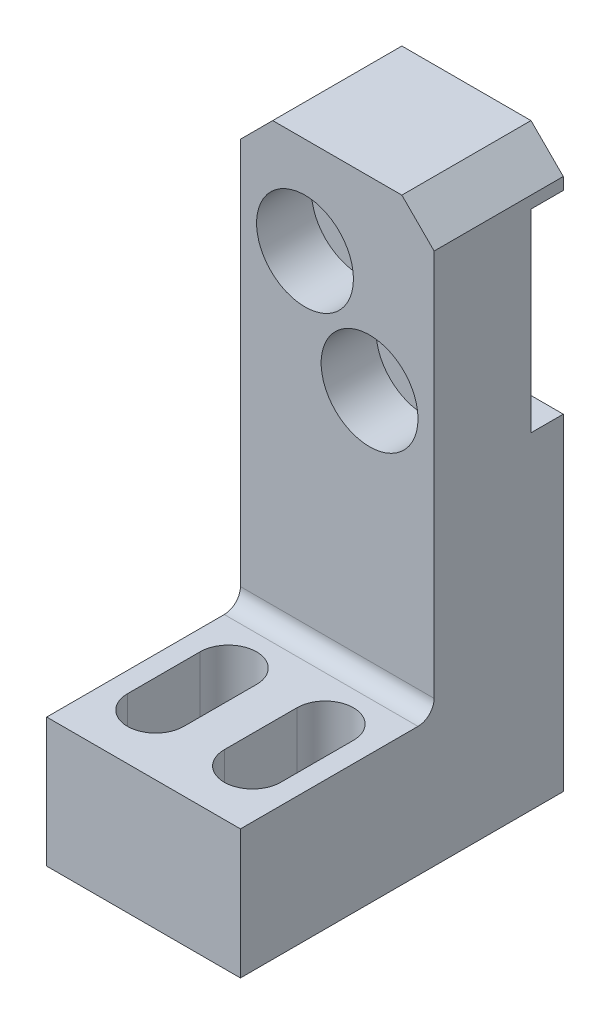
ISO-10303-21;
HEADER;
FILE_DESCRIPTION(('STEP AP214'),'2;1');
FILE_NAME('part.step','',(''),(''),'','','');
FILE_SCHEMA(('AUTOMOTIVE_DESIGN { 1 0 10303 214 1 1 1 1 }'));
ENDSEC;
DATA;
#1=APPLICATION_CONTEXT('core data for automotive mechanical design processes');
#2=APPLICATION_PROTOCOL_DEFINITION('international standard','automotive_design',2000,#1);
#3=PRODUCT_CONTEXT('',#1,'mechanical');
#4=PRODUCT('Part','Part','',(#3));
#5=PRODUCT_RELATED_PRODUCT_CATEGORY('part','',(#4));
#6=PRODUCT_DEFINITION_FORMATION('','',#4);
#7=PRODUCT_DEFINITION_CONTEXT('part definition',#1,'design');
#8=PRODUCT_DEFINITION('design','',#6,#7);
#9=PRODUCT_DEFINITION_SHAPE('','',#8);
#10=(LENGTH_UNIT() NAMED_UNIT(*) SI_UNIT(.MILLI.,.METRE.));
#11=(NAMED_UNIT(*) PLANE_ANGLE_UNIT() SI_UNIT($,.RADIAN.));
#12=(NAMED_UNIT(*) SI_UNIT($,.STERADIAN.) SOLID_ANGLE_UNIT());
#13=UNCERTAINTY_MEASURE_WITH_UNIT(LENGTH_MEASURE(1.E-05),#10,'distance_accuracy_value','');
#14=(GEOMETRIC_REPRESENTATION_CONTEXT(3) GLOBAL_UNCERTAINTY_ASSIGNED_CONTEXT((#13)) GLOBAL_UNIT_ASSIGNED_CONTEXT((#10,
#11,#12)) REPRESENTATION_CONTEXT('',''));
#15=CARTESIAN_POINT('',(0.,0.,0.));
#16=DIRECTION('',(0.,0.,1.));
#17=DIRECTION('',(1.,0.,0.));
#18=AXIS2_PLACEMENT_3D('',#15,#16,#17);
#19=CARTESIAN_POINT('',(0.,-35.,8.));
#20=DIRECTION('',(0.,1.,0.));
#21=DIRECTION('',(0.,0.,1.));
#22=AXIS2_PLACEMENT_3D('',#19,#20,#21);
#23=PLANE('',#22);
#24=DIRECTION('',(0.,0.,-1.));
#25=VECTOR('',#24,1.);
#26=CARTESIAN_POINT('',(1.25000000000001,-35.,16.25));
#27=LINE('',#26,#25);
#28=CARTESIAN_POINT('',(1.25,-35.,16.25));
#29=VERTEX_POINT('',#28);
#30=CARTESIAN_POINT('',(1.25000000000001,-35.,11.75));
#31=VERTEX_POINT('',#30);
#32=EDGE_CURVE('E199',#29,#31,#27,.T.);
#33=ORIENTED_EDGE('',*,*,#32,.F.);
#34=CARTESIAN_POINT('',(3.,-35.,16.25));
#35=DIRECTION('',(0.,1.,0.));
#36=DIRECTION('',(0.,0.,1.));
#37=AXIS2_PLACEMENT_3D('',#34,#35,#36);
#38=CIRCLE('',#37,1.75);
#39=CARTESIAN_POINT('',(4.75,-35.,16.25));
#40=VERTEX_POINT('',#39);
#41=EDGE_CURVE('E210',#29,#40,#38,.T.);
#42=ORIENTED_EDGE('',*,*,#41,.T.);
#43=DIRECTION('',(0.,0.,-1.));
#44=VECTOR('',#43,1.);
#45=CARTESIAN_POINT('',(4.75,-35.,16.25));
#46=LINE('',#45,#44);
#47=CARTESIAN_POINT('',(4.75,-35.,11.75));
#48=VERTEX_POINT('',#47);
#49=EDGE_CURVE('E196',#40,#48,#46,.T.);
#50=ORIENTED_EDGE('',*,*,#49,.T.);
#51=CARTESIAN_POINT('',(3.,-35.,11.75));
#52=DIRECTION('',(0.,1.,0.));
#53=DIRECTION('',(0.,0.,1.));
#54=AXIS2_PLACEMENT_3D('',#51,#52,#53);
#55=CIRCLE('',#54,1.75);
#56=EDGE_CURVE('E220',#48,#31,#55,.T.);
#57=ORIENTED_EDGE('',*,*,#56,.T.);
#58=EDGE_LOOP('',(#33,#42,#50,#57));
#59=FACE_BOUND('',#58,.T.);
#60=DIRECTION('',(1.,0.,0.));
#61=VECTOR('',#60,1.);
#62=CARTESIAN_POINT('',(0.,-35.,0.));
#63=LINE('',#62,#61);
#64=CARTESIAN_POINT('',(0.,-35.,0.));
#65=VERTEX_POINT('',#64);
#66=CARTESIAN_POINT('',(12.,-35.,0.));
#67=VERTEX_POINT('',#66);
#68=EDGE_CURVE('E313',#65,#67,#63,.T.);
#69=ORIENTED_EDGE('',*,*,#68,.T.);
#70=DIRECTION('',(0.,0.,-1.));
#71=VECTOR('',#70,1.);
#72=CARTESIAN_POINT('',(12.,-35.,8.));
#73=LINE('',#72,#71);
#74=CARTESIAN_POINT('',(12.,-35.,20.));
#75=VERTEX_POINT('',#74);
#76=EDGE_CURVE('E304',#75,#67,#73,.T.);
#77=ORIENTED_EDGE('',*,*,#76,.F.);
#78=DIRECTION('',(-1.,0.,0.));
#79=VECTOR('',#78,1.);
#80=CARTESIAN_POINT('',(12.,-35.,20.));
#81=LINE('',#80,#79);
#82=CARTESIAN_POINT('',(0.,-35.,20.));
#83=VERTEX_POINT('',#82);
#84=EDGE_CURVE('E275',#75,#83,#81,.T.);
#85=ORIENTED_EDGE('',*,*,#84,.T.);
#86=DIRECTION('',(0.,0.,-1.));
#87=VECTOR('',#86,1.);
#88=CARTESIAN_POINT('',(0.,-35.,8.));
#89=LINE('',#88,#87);
#90=EDGE_CURVE('E308',#83,#65,#89,.T.);
#91=ORIENTED_EDGE('',*,*,#90,.T.);
#92=EDGE_LOOP('',(#69,#77,#85,#91));
#93=FACE_BOUND('',#92,.T.);
#94=DIRECTION('',(0.,0.,-1.));
#95=VECTOR('',#94,1.);
#96=CARTESIAN_POINT('',(7.25,-35.,16.25));
#97=LINE('',#96,#95);
#98=CARTESIAN_POINT('',(7.25,-35.,16.25));
#99=VERTEX_POINT('',#98);
#100=CARTESIAN_POINT('',(7.25,-35.,11.75));
#101=VERTEX_POINT('',#100);
#102=EDGE_CURVE('E169',#99,#101,#97,.T.);
#103=ORIENTED_EDGE('',*,*,#102,.F.);
#104=CARTESIAN_POINT('',(9.,-35.,16.25));
#105=DIRECTION('',(0.,1.,0.));
#106=DIRECTION('',(0.,0.,1.));
#107=AXIS2_PLACEMENT_3D('',#104,#105,#106);
#108=CIRCLE('',#107,1.75);
#109=CARTESIAN_POINT('',(10.75,-35.,16.25));
#110=VERTEX_POINT('',#109);
#111=EDGE_CURVE('E175',#99,#110,#108,.T.);
#112=ORIENTED_EDGE('',*,*,#111,.T.);
#113=DIRECTION('',(0.,0.,-1.));
#114=VECTOR('',#113,1.);
#115=CARTESIAN_POINT('',(10.75,-35.,16.25));
#116=LINE('',#115,#114);
#117=CARTESIAN_POINT('',(10.75,-35.,11.75));
#118=VERTEX_POINT('',#117);
#119=EDGE_CURVE('E158',#110,#118,#116,.T.);
#120=ORIENTED_EDGE('',*,*,#119,.T.);
#121=CARTESIAN_POINT('',(9.,-35.,11.75));
#122=DIRECTION('',(0.,1.,0.));
#123=DIRECTION('',(0.,0.,1.));
#124=AXIS2_PLACEMENT_3D('',#121,#122,#123);
#125=CIRCLE('',#124,1.75);
#126=EDGE_CURVE('E190',#118,#101,#125,.T.);
#127=ORIENTED_EDGE('',*,*,#126,.T.);
#128=EDGE_LOOP('',(#103,#112,#120,#127));
#129=FACE_BOUND('',#128,.T.);
#130=ADVANCED_FACE('F16',(#59,#93,#129),#23,.F.);
#131=CARTESIAN_POINT('',(0.,0.,0.));
#132=DIRECTION('',(0.,0.,1.));
#133=DIRECTION('',(1.,0.,0.));
#134=AXIS2_PLACEMENT_3D('',#131,#132,#133);
#135=PLANE('',#134);
#136=DIRECTION('',(-1.,0.,0.));
#137=VECTOR('',#136,1.);
#138=CARTESIAN_POINT('',(0.,0.,0.));
#139=LINE('',#138,#137);
#140=CARTESIAN_POINT('',(10.,0.,0.));
#141=VERTEX_POINT('',#140);
#142=CARTESIAN_POINT('',(2.,0.,0.));
#143=VERTEX_POINT('',#142);
#144=EDGE_CURVE('E287',#141,#143,#139,.T.);
#145=ORIENTED_EDGE('',*,*,#144,.F.);
#146=DIRECTION('',(-0.707106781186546,0.707106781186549,0.));
#147=VECTOR('',#146,1.);
#148=CARTESIAN_POINT('',(10.,0.,0.));
#149=LINE('',#148,#147);
#150=CARTESIAN_POINT('',(12.,-2.,0.));
#151=VERTEX_POINT('',#150);
#152=EDGE_CURVE('E349',#141,#151,#149,.F.);
#153=ORIENTED_EDGE('',*,*,#152,.T.);
#154=DIRECTION('',(0.,1.,0.));
#155=VECTOR('',#154,1.);
#156=CARTESIAN_POINT('',(12.,0.,0.));
#157=LINE('',#156,#155);
#158=CARTESIAN_POINT('',(12.,-2.75,0.));
#159=VERTEX_POINT('',#158);
#160=EDGE_CURVE('E315',#159,#151,#157,.T.);
#161=ORIENTED_EDGE('',*,*,#160,.F.);
#162=DIRECTION('',(-1.,0.,0.));
#163=VECTOR('',#162,1.);
#164=CARTESIAN_POINT('',(0.,-2.75,0.));
#165=LINE('',#164,#163);
#166=CARTESIAN_POINT('',(0.,-2.75,0.));
#167=VERTEX_POINT('',#166);
#168=EDGE_CURVE('E333',#159,#167,#165,.T.);
#169=ORIENTED_EDGE('',*,*,#168,.T.);
#170=DIRECTION('',(0.,-1.,0.));
#171=VECTOR('',#170,1.);
#172=CARTESIAN_POINT('',(0.,0.,0.));
#173=LINE('',#172,#171);
#174=CARTESIAN_POINT('',(0.,-2.,0.));
#175=VERTEX_POINT('',#174);
#176=EDGE_CURVE('E311',#175,#167,#173,.T.);
#177=ORIENTED_EDGE('',*,*,#176,.F.);
#178=DIRECTION('',(-0.707106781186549,-0.707106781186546,0.));
#179=VECTOR('',#178,1.);
#180=CARTESIAN_POINT('',(0.,-2.,0.));
#181=LINE('',#180,#179);
#182=EDGE_CURVE('E348',#175,#143,#181,.F.);
#183=ORIENTED_EDGE('',*,*,#182,.T.);
#184=EDGE_LOOP('',(#145,#153,#161,#169,#177,#183));
#185=FACE_BOUND('',#184,.T.);
#186=ADVANCED_FACE('F372',(#185),#135,.F.);
#187=CARTESIAN_POINT('',(0.,0.,8.));
#188=DIRECTION('',(1.,0.,0.));
#189=DIRECTION('',(0.,1.,0.));
#190=AXIS2_PLACEMENT_3D('',#187,#188,#189);
#191=PLANE('',#190);
#192=DIRECTION('',(0.,-1.,0.));
#193=VECTOR('',#192,1.);
#194=CARTESIAN_POINT('',(0.,0.,8.));
#195=LINE('',#194,#193);
#196=CARTESIAN_POINT('',(0.,-2.,8.));
#197=VERTEX_POINT('',#196);
#198=CARTESIAN_POINT('',(0.,-26.,8.));
#199=VERTEX_POINT('',#198);
#200=EDGE_CURVE('E283',#197,#199,#195,.T.);
#201=ORIENTED_EDGE('',*,*,#200,.F.);
#202=DIRECTION('',(0.,0.,-1.));
#203=VECTOR('',#202,1.);
#204=CARTESIAN_POINT('',(0.,-2.,8.));
#205=LINE('',#204,#203);
#206=EDGE_CURVE('E294',#197,#175,#205,.T.);
#207=ORIENTED_EDGE('',*,*,#206,.T.);
#208=ORIENTED_EDGE('',*,*,#176,.T.);
#209=DIRECTION('',(0.,0.,-1.));
#210=VECTOR('',#209,1.);
#211=CARTESIAN_POINT('',(0.,-2.75,0.));
#212=LINE('',#211,#210);
#213=CARTESIAN_POINT('',(0.,-2.75,2.));
#214=VERTEX_POINT('',#213);
#215=EDGE_CURVE('E251',#214,#167,#212,.T.);
#216=ORIENTED_EDGE('',*,*,#215,.F.);
#217=DIRECTION('',(0.,1.,0.));
#218=VECTOR('',#217,1.);
#219=CARTESIAN_POINT('',(0.,-2.75,2.));
#220=LINE('',#219,#218);
#221=CARTESIAN_POINT('',(0.,-14.75,2.));
#222=VERTEX_POINT('',#221);
#223=EDGE_CURVE('E248',#222,#214,#220,.T.);
#224=ORIENTED_EDGE('',*,*,#223,.F.);
#225=DIRECTION('',(0.,0.,1.));
#226=VECTOR('',#225,1.);
#227=CARTESIAN_POINT('',(0.,-14.75,0.));
#228=LINE('',#227,#226);
#229=CARTESIAN_POINT('',(0.,-14.75,0.));
#230=VERTEX_POINT('',#229);
#231=EDGE_CURVE('E245',#230,#222,#228,.T.);
#232=ORIENTED_EDGE('',*,*,#231,.F.);
#233=EDGE_CURVE('E274',#230,#65,#173,.T.);
#234=ORIENTED_EDGE('',*,*,#233,.T.);
#235=ORIENTED_EDGE('',*,*,#90,.F.);
#236=DIRECTION('',(0.,1.,0.));
#237=VECTOR('',#236,1.);
#238=CARTESIAN_POINT('',(0.,-35.,20.));
#239=LINE('',#238,#237);
#240=CARTESIAN_POINT('',(0.,-27.,20.));
#241=VERTEX_POINT('',#240);
#242=EDGE_CURVE('E264',#83,#241,#239,.T.);
#243=ORIENTED_EDGE('',*,*,#242,.T.);
#244=DIRECTION('',(0.,0.,-1.));
#245=VECTOR('',#244,1.);
#246=CARTESIAN_POINT('',(0.,-27.,8.));
#247=LINE('',#246,#245);
#248=CARTESIAN_POINT('',(0.,-27.,9.));
#249=VERTEX_POINT('',#248);
#250=EDGE_CURVE('E269',#241,#249,#247,.T.);
#251=ORIENTED_EDGE('',*,*,#250,.T.);
#252=CARTESIAN_POINT('',(0.,-26.,9.));
#253=DIRECTION('',(1.,0.,0.));
#254=DIRECTION('',(0.,1.,0.));
#255=AXIS2_PLACEMENT_3D('',#252,#253,#254);
#256=CIRCLE('',#255,1.);
#257=EDGE_CURVE('E24',#249,#199,#256,.T.);
#258=ORIENTED_EDGE('',*,*,#257,.T.);
#259=EDGE_LOOP('',(#201,#207,#208,#216,#224,#232,#234,#235,#243,#251,#258));
#260=FACE_BOUND('',#259,.T.);
#261=ADVANCED_FACE('F369',(#260),#191,.F.);
#262=CARTESIAN_POINT('',(12.,0.,8.));
#263=DIRECTION('',(-1.,0.,0.));
#264=DIRECTION('',(0.,-1.,0.));
#265=AXIS2_PLACEMENT_3D('',#262,#263,#264);
#266=PLANE('',#265);
#267=ORIENTED_EDGE('',*,*,#160,.T.);
#268=DIRECTION('',(0.,0.,1.));
#269=VECTOR('',#268,1.);
#270=CARTESIAN_POINT('',(12.,-2.,8.));
#271=LINE('',#270,#269);
#272=CARTESIAN_POINT('',(12.,-2.,8.));
#273=VERTEX_POINT('',#272);
#274=EDGE_CURVE('E288',#151,#273,#271,.T.);
#275=ORIENTED_EDGE('',*,*,#274,.T.);
#276=DIRECTION('',(0.,1.,0.));
#277=VECTOR('',#276,1.);
#278=CARTESIAN_POINT('',(12.,0.,8.));
#279=LINE('',#278,#277);
#280=CARTESIAN_POINT('',(12.,-26.,8.));
#281=VERTEX_POINT('',#280);
#282=EDGE_CURVE('E286',#281,#273,#279,.T.);
#283=ORIENTED_EDGE('',*,*,#282,.F.);
#284=CARTESIAN_POINT('',(12.,-26.,9.));
#285=DIRECTION('',(-1.,0.,0.));
#286=DIRECTION('',(0.,-1.,0.));
#287=AXIS2_PLACEMENT_3D('',#284,#285,#286);
#288=CIRCLE('',#287,1.);
#289=CARTESIAN_POINT('',(12.,-27.,9.));
#290=VERTEX_POINT('',#289);
#291=EDGE_CURVE('E11',#281,#290,#288,.T.);
#292=ORIENTED_EDGE('',*,*,#291,.T.);
#293=DIRECTION('',(0.,0.,-1.));
#294=VECTOR('',#293,1.);
#295=CARTESIAN_POINT('',(12.,-27.,8.));
#296=LINE('',#295,#294);
#297=CARTESIAN_POINT('',(12.,-27.,20.));
#298=VERTEX_POINT('',#297);
#299=EDGE_CURVE('E268',#298,#290,#296,.T.);
#300=ORIENTED_EDGE('',*,*,#299,.F.);
#301=DIRECTION('',(0.,1.,0.));
#302=VECTOR('',#301,1.);
#303=CARTESIAN_POINT('',(12.,-35.,20.));
#304=LINE('',#303,#302);
#305=EDGE_CURVE('E265',#75,#298,#304,.T.);
#306=ORIENTED_EDGE('',*,*,#305,.F.);
#307=ORIENTED_EDGE('',*,*,#76,.T.);
#308=CARTESIAN_POINT('',(12.,-14.75,0.));
#309=VERTEX_POINT('',#308);
#310=EDGE_CURVE('E316',#67,#309,#157,.T.);
#311=ORIENTED_EDGE('',*,*,#310,.T.);
#312=DIRECTION('',(0.,0.,1.));
#313=VECTOR('',#312,1.);
#314=CARTESIAN_POINT('',(12.,-14.75,8.));
#315=LINE('',#314,#313);
#316=CARTESIAN_POINT('',(12.,-14.75,2.));
#317=VERTEX_POINT('',#316);
#318=EDGE_CURVE('E257',#309,#317,#315,.T.);
#319=ORIENTED_EDGE('',*,*,#318,.T.);
#320=DIRECTION('',(0.,1.,0.));
#321=VECTOR('',#320,1.);
#322=CARTESIAN_POINT('',(12.,0.,2.));
#323=LINE('',#322,#321);
#324=CARTESIAN_POINT('',(12.,-2.75,2.));
#325=VERTEX_POINT('',#324);
#326=EDGE_CURVE('E336',#317,#325,#323,.T.);
#327=ORIENTED_EDGE('',*,*,#326,.T.);
#328=DIRECTION('',(0.,0.,-1.));
#329=VECTOR('',#328,1.);
#330=CARTESIAN_POINT('',(12.,-2.75,8.));
#331=LINE('',#330,#329);
#332=EDGE_CURVE('E261',#325,#159,#331,.T.);
#333=ORIENTED_EDGE('',*,*,#332,.T.);
#334=EDGE_LOOP('',(#267,#275,#283,#292,#300,#306,#307,#311,#319,#327,#333));
#335=FACE_BOUND('',#334,.T.);
#336=ADVANCED_FACE('F357',(#335),#266,.F.);
#337=CARTESIAN_POINT('',(0.,0.,8.));
#338=DIRECTION('',(0.,-1.,0.));
#339=DIRECTION('',(0.,0.,-1.));
#340=AXIS2_PLACEMENT_3D('',#337,#338,#339);
#341=PLANE('',#340);
#342=DIRECTION('',(-1.,0.,0.));
#343=VECTOR('',#342,1.);
#344=CARTESIAN_POINT('',(0.,0.,8.));
#345=LINE('',#344,#343);
#346=CARTESIAN_POINT('',(10.,0.,8.));
#347=VERTEX_POINT('',#346);
#348=CARTESIAN_POINT('',(2.,0.,8.));
#349=VERTEX_POINT('',#348);
#350=EDGE_CURVE('E301',#347,#349,#345,.T.);
#351=ORIENTED_EDGE('',*,*,#350,.F.);
#352=DIRECTION('',(0.,0.,-1.));
#353=VECTOR('',#352,1.);
#354=CARTESIAN_POINT('',(10.,0.,8.));
#355=LINE('',#354,#353);
#356=EDGE_CURVE('E345',#347,#141,#355,.T.);
#357=ORIENTED_EDGE('',*,*,#356,.T.);
#358=ORIENTED_EDGE('',*,*,#144,.T.);
#359=DIRECTION('',(0.,0.,1.));
#360=VECTOR('',#359,1.);
#361=CARTESIAN_POINT('',(2.,0.,8.));
#362=LINE('',#361,#360);
#363=EDGE_CURVE('E339',#143,#349,#362,.T.);
#364=ORIENTED_EDGE('',*,*,#363,.T.);
#365=EDGE_LOOP('',(#351,#357,#358,#364));
#366=FACE_BOUND('',#365,.T.);
#367=ADVANCED_FACE('F364',(#366),#341,.F.);
#368=CARTESIAN_POINT('',(0.,0.,8.));
#369=DIRECTION('',(0.,0.,1.));
#370=DIRECTION('',(1.,0.,0.));
#371=AXIS2_PLACEMENT_3D('',#368,#369,#370);
#372=PLANE('',#371);
#373=CARTESIAN_POINT('',(4.,-6.,8.));
#374=DIRECTION('',(0.,0.,1.));
#375=DIRECTION('',(1.,0.,0.));
#376=AXIS2_PLACEMENT_3D('',#373,#374,#375);
#377=CIRCLE('',#376,3.);
#378=CARTESIAN_POINT('',(7.,-6.,8.));
#379=VERTEX_POINT('',#378);
#380=EDGE_CURVE('E225',#379,#379,#377,.T.);
#381=ORIENTED_EDGE('',*,*,#380,.F.);
#382=EDGE_LOOP('',(#381));
#383=FACE_BOUND('',#382,.T.);
#384=CARTESIAN_POINT('',(8.,-11.5,8.));
#385=DIRECTION('',(0.,0.,1.));
#386=DIRECTION('',(1.,0.,0.));
#387=AXIS2_PLACEMENT_3D('',#384,#385,#386);
#388=CIRCLE('',#387,3.);
#389=CARTESIAN_POINT('',(11.,-11.5,8.));
#390=VERTEX_POINT('',#389);
#391=EDGE_CURVE('E235',#390,#390,#388,.T.);
#392=ORIENTED_EDGE('',*,*,#391,.F.);
#393=EDGE_LOOP('',(#392));
#394=FACE_BOUND('',#393,.T.);
#395=ORIENTED_EDGE('',*,*,#200,.T.);
#396=DIRECTION('',(-1.,0.,0.));
#397=VECTOR('',#396,1.);
#398=CARTESIAN_POINT('',(12.,-26.,8.));
#399=LINE('',#398,#397);
#400=EDGE_CURVE('E37',#199,#281,#399,.F.);
#401=ORIENTED_EDGE('',*,*,#400,.T.);
#402=ORIENTED_EDGE('',*,*,#282,.T.);
#403=DIRECTION('',(0.707106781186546,-0.707106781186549,0.));
#404=VECTOR('',#403,1.);
#405=CARTESIAN_POINT('',(5.,5.,8.));
#406=LINE('',#405,#404);
#407=EDGE_CURVE('E292',#273,#347,#406,.F.);
#408=ORIENTED_EDGE('',*,*,#407,.T.);
#409=ORIENTED_EDGE('',*,*,#350,.T.);
#410=DIRECTION('',(0.707106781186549,0.707106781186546,0.));
#411=VECTOR('',#410,1.);
#412=CARTESIAN_POINT('',(1.,-1.,8.));
#413=LINE('',#412,#411);
#414=EDGE_CURVE('E290',#349,#197,#413,.F.);
#415=ORIENTED_EDGE('',*,*,#414,.T.);
#416=EDGE_LOOP('',(#395,#401,#402,#408,#409,#415));
#417=FACE_BOUND('',#416,.T.);
#418=ADVANCED_FACE('F362',(#383,#394,#417),#372,.T.);
#419=ORIENTED_EDGE('',*,*,#233,.F.);
#420=DIRECTION('',(1.,0.,0.));
#421=VECTOR('',#420,1.);
#422=CARTESIAN_POINT('',(0.,-14.75,0.));
#423=LINE('',#422,#421);
#424=EDGE_CURVE('E323',#230,#309,#423,.T.);
#425=ORIENTED_EDGE('',*,*,#424,.T.);
#426=ORIENTED_EDGE('',*,*,#310,.F.);
#427=ORIENTED_EDGE('',*,*,#68,.F.);
#428=EDGE_LOOP('',(#419,#425,#426,#427));
#429=FACE_BOUND('',#428,.T.);
#430=ADVANCED_FACE('F386',(#429),#135,.F.);
#431=CARTESIAN_POINT('',(12.,-27.,8.));
#432=DIRECTION('',(0.,1.,0.));
#433=DIRECTION('',(-1.,0.,0.));
#434=AXIS2_PLACEMENT_3D('',#431,#432,#433);
#435=PLANE('',#434);
#436=CARTESIAN_POINT('',(9.,-27.,11.75));
#437=DIRECTION('',(0.,1.,0.));
#438=DIRECTION('',(0.,0.,1.));
#439=AXIS2_PLACEMENT_3D('',#436,#437,#438);
#440=CIRCLE('',#439,1.75);
#441=CARTESIAN_POINT('',(10.75,-27.,11.75));
#442=VERTEX_POINT('',#441);
#443=CARTESIAN_POINT('',(7.25,-27.,11.75));
#444=VERTEX_POINT('',#443);
#445=EDGE_CURVE('E187',#442,#444,#440,.T.);
#446=ORIENTED_EDGE('',*,*,#445,.F.);
#447=DIRECTION('',(0.,0.,-1.));
#448=VECTOR('',#447,1.);
#449=CARTESIAN_POINT('',(10.75,-27.,16.25));
#450=LINE('',#449,#448);
#451=CARTESIAN_POINT('',(10.75,-27.,16.25));
#452=VERTEX_POINT('',#451);
#453=EDGE_CURVE('E170',#452,#442,#450,.T.);
#454=ORIENTED_EDGE('',*,*,#453,.F.);
#455=CARTESIAN_POINT('',(9.,-27.,16.25));
#456=DIRECTION('',(0.,1.,0.));
#457=DIRECTION('',(0.,0.,1.));
#458=AXIS2_PLACEMENT_3D('',#455,#456,#457);
#459=CIRCLE('',#458,1.75);
#460=CARTESIAN_POINT('',(7.25,-27.,16.25));
#461=VERTEX_POINT('',#460);
#462=EDGE_CURVE('E178',#461,#452,#459,.T.);
#463=ORIENTED_EDGE('',*,*,#462,.F.);
#464=DIRECTION('',(0.,0.,-1.));
#465=VECTOR('',#464,1.);
#466=CARTESIAN_POINT('',(7.25,-27.,16.25));
#467=LINE('',#466,#465);
#468=EDGE_CURVE('E179',#461,#444,#467,.T.);
#469=ORIENTED_EDGE('',*,*,#468,.T.);
#470=EDGE_LOOP('',(#446,#454,#463,#469));
#471=FACE_BOUND('',#470,.T.);
#472=CARTESIAN_POINT('',(3.,-27.,11.75));
#473=DIRECTION('',(0.,1.,0.));
#474=DIRECTION('',(0.,0.,1.));
#475=AXIS2_PLACEMENT_3D('',#472,#473,#474);
#476=CIRCLE('',#475,1.75);
#477=CARTESIAN_POINT('',(4.75,-27.,11.75));
#478=VERTEX_POINT('',#477);
#479=CARTESIAN_POINT('',(1.25000000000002,-27.,11.75));
#480=VERTEX_POINT('',#479);
#481=EDGE_CURVE('E217',#478,#480,#476,.T.);
#482=ORIENTED_EDGE('',*,*,#481,.F.);
#483=DIRECTION('',(0.,0.,-1.));
#484=VECTOR('',#483,1.);
#485=CARTESIAN_POINT('',(4.75,-27.,16.25));
#486=LINE('',#485,#484);
#487=CARTESIAN_POINT('',(4.75,-27.,16.25));
#488=VERTEX_POINT('',#487);
#489=EDGE_CURVE('E194',#488,#478,#486,.T.);
#490=ORIENTED_EDGE('',*,*,#489,.F.);
#491=CARTESIAN_POINT('',(3.,-27.,16.25));
#492=DIRECTION('',(0.,1.,0.));
#493=DIRECTION('',(0.,0.,1.));
#494=AXIS2_PLACEMENT_3D('',#491,#492,#493);
#495=CIRCLE('',#494,1.75);
#496=CARTESIAN_POINT('',(1.24999999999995,-27.,16.25));
#497=VERTEX_POINT('',#496);
#498=EDGE_CURVE('E207',#497,#488,#495,.T.);
#499=ORIENTED_EDGE('',*,*,#498,.F.);
#500=DIRECTION('',(0.,0.,-1.));
#501=VECTOR('',#500,1.);
#502=CARTESIAN_POINT('',(1.25000000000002,-27.,16.25));
#503=LINE('',#502,#501);
#504=EDGE_CURVE('E201',#497,#480,#503,.T.);
#505=ORIENTED_EDGE('',*,*,#504,.T.);
#506=EDGE_LOOP('',(#482,#490,#499,#505));
#507=FACE_BOUND('',#506,.T.);
#508=ORIENTED_EDGE('',*,*,#299,.T.);
#509=DIRECTION('',(-1.,0.,0.));
#510=VECTOR('',#509,1.);
#511=CARTESIAN_POINT('',(0.,-27.,9.));
#512=LINE('',#511,#510);
#513=EDGE_CURVE('E297',#290,#249,#512,.T.);
#514=ORIENTED_EDGE('',*,*,#513,.T.);
#515=ORIENTED_EDGE('',*,*,#250,.F.);
#516=DIRECTION('',(-1.,0.,0.));
#517=VECTOR('',#516,1.);
#518=CARTESIAN_POINT('',(12.,-27.,20.));
#519=LINE('',#518,#517);
#520=EDGE_CURVE('E272',#298,#241,#519,.T.);
#521=ORIENTED_EDGE('',*,*,#520,.F.);
#522=EDGE_LOOP('',(#508,#514,#515,#521));
#523=FACE_BOUND('',#522,.T.);
#524=ADVANCED_FACE('F394',(#471,#507,#523),#435,.T.);
#525=CARTESIAN_POINT('',(12.,-35.,20.));
#526=DIRECTION('',(0.,0.,1.));
#527=DIRECTION('',(1.,0.,0.));
#528=AXIS2_PLACEMENT_3D('',#525,#526,#527);
#529=PLANE('',#528);
#530=ORIENTED_EDGE('',*,*,#242,.F.);
#531=ORIENTED_EDGE('',*,*,#84,.F.);
#532=ORIENTED_EDGE('',*,*,#305,.T.);
#533=ORIENTED_EDGE('',*,*,#520,.T.);
#534=EDGE_LOOP('',(#530,#531,#532,#533));
#535=FACE_BOUND('',#534,.T.);
#536=ADVANCED_FACE('F399',(#535),#529,.T.);
#537=CARTESIAN_POINT('',(12.00005,-2.75,2.));
#538=DIRECTION('',(0.,0.,1.));
#539=DIRECTION('',(0.,-1.,0.));
#540=AXIS2_PLACEMENT_3D('',#537,#538,#539);
#541=PLANE('',#540);
#542=CARTESIAN_POINT('',(4.,-6.,2.));
#543=DIRECTION('',(0.,0.,1.));
#544=DIRECTION('',(0.,-1.,0.));
#545=AXIS2_PLACEMENT_3D('',#542,#543,#544);
#546=CIRCLE('',#545,1.7);
#547=CARTESIAN_POINT('',(4.,-7.7,2.));
#548=VERTEX_POINT('',#547);
#549=EDGE_CURVE('E234',#548,#548,#546,.T.);
#550=ORIENTED_EDGE('',*,*,#549,.T.);
#551=EDGE_LOOP('',(#550));
#552=FACE_BOUND('',#551,.T.);
#553=CARTESIAN_POINT('',(8.,-11.5,2.));
#554=DIRECTION('',(0.,0.,1.));
#555=DIRECTION('',(0.,-1.,0.));
#556=AXIS2_PLACEMENT_3D('',#553,#554,#555);
#557=CIRCLE('',#556,1.7);
#558=CARTESIAN_POINT('',(8.,-13.2,2.));
#559=VERTEX_POINT('',#558);
#560=EDGE_CURVE('E244',#559,#559,#557,.T.);
#561=ORIENTED_EDGE('',*,*,#560,.T.);
#562=EDGE_LOOP('',(#561));
#563=FACE_BOUND('',#562,.T.);
#564=DIRECTION('',(-1.,0.,0.));
#565=VECTOR('',#564,1.);
#566=CARTESIAN_POINT('',(12.00005,-14.75,2.));
#567=LINE('',#566,#565);
#568=EDGE_CURVE('E254',#317,#222,#567,.T.);
#569=ORIENTED_EDGE('',*,*,#568,.T.);
#570=ORIENTED_EDGE('',*,*,#223,.T.);
#571=DIRECTION('',(-1.,0.,0.));
#572=VECTOR('',#571,1.);
#573=CARTESIAN_POINT('',(12.00005,-2.75,2.));
#574=LINE('',#573,#572);
#575=EDGE_CURVE('E255',#325,#214,#574,.T.);
#576=ORIENTED_EDGE('',*,*,#575,.F.);
#577=ORIENTED_EDGE('',*,*,#326,.F.);
#578=EDGE_LOOP('',(#569,#570,#576,#577));
#579=FACE_BOUND('',#578,.T.);
#580=ADVANCED_FACE('F378',(#552,#563,#579),#541,.F.);
#581=CARTESIAN_POINT('',(12.00005,-2.75,0.));
#582=DIRECTION('',(0.,1.,0.));
#583=DIRECTION('',(-1.,0.,0.));
#584=AXIS2_PLACEMENT_3D('',#581,#582,#583);
#585=PLANE('',#584);
#586=ORIENTED_EDGE('',*,*,#575,.T.);
#587=ORIENTED_EDGE('',*,*,#215,.T.);
#588=ORIENTED_EDGE('',*,*,#168,.F.);
#589=ORIENTED_EDGE('',*,*,#332,.F.);
#590=EDGE_LOOP('',(#586,#587,#588,#589));
#591=FACE_BOUND('',#590,.T.);
#592=ADVANCED_FACE('F374',(#591),#585,.F.);
#593=CARTESIAN_POINT('',(12.00005,-14.75,0.));
#594=DIRECTION('',(0.,-1.,0.));
#595=DIRECTION('',(1.,0.,0.));
#596=AXIS2_PLACEMENT_3D('',#593,#594,#595);
#597=PLANE('',#596);
#598=ORIENTED_EDGE('',*,*,#424,.F.);
#599=ORIENTED_EDGE('',*,*,#231,.T.);
#600=ORIENTED_EDGE('',*,*,#568,.F.);
#601=ORIENTED_EDGE('',*,*,#318,.F.);
#602=EDGE_LOOP('',(#598,#599,#600,#601));
#603=FACE_BOUND('',#602,.T.);
#604=ADVANCED_FACE('F380',(#603),#597,.F.);
#605=CARTESIAN_POINT('',(8.,-11.5,8.));
#606=DIRECTION('',(0.,0.,1.));
#607=DIRECTION('',(1.,0.,0.));
#608=AXIS2_PLACEMENT_3D('',#605,#606,#607);
#609=CYLINDRICAL_SURFACE('',#608,1.7);
#610=CARTESIAN_POINT('',(8.,-11.5,4.6));
#611=DIRECTION('',(0.,0.,1.));
#612=DIRECTION('',(1.,0.,0.));
#613=AXIS2_PLACEMENT_3D('',#610,#611,#612);
#614=CIRCLE('',#613,1.7);
#615=CARTESIAN_POINT('',(9.7,-11.5,4.6));
#616=VERTEX_POINT('',#615);
#617=EDGE_CURVE('E241',#616,#616,#614,.T.);
#618=ORIENTED_EDGE('',*,*,#617,.T.);
#619=EDGE_LOOP('',(#618));
#620=FACE_BOUND('',#619,.T.);
#621=ORIENTED_EDGE('',*,*,#560,.F.);
#622=EDGE_LOOP('',(#621));
#623=FACE_BOUND('',#622,.T.);
#624=ADVANCED_FACE('F466',(#620,#623),#609,.F.);
#625=CARTESIAN_POINT('',(9.7,-11.5,4.6));
#626=DIRECTION('',(0.,0.,-1.));
#627=DIRECTION('',(-1.,0.,0.));
#628=AXIS2_PLACEMENT_3D('',#625,#626,#627);
#629=PLANE('',#628);
#630=ORIENTED_EDGE('',*,*,#617,.F.);
#631=EDGE_LOOP('',(#630));
#632=FACE_BOUND('',#631,.T.);
#633=CARTESIAN_POINT('',(8.,-11.5,4.6));
#634=DIRECTION('',(0.,0.,1.));
#635=DIRECTION('',(1.,0.,0.));
#636=AXIS2_PLACEMENT_3D('',#633,#634,#635);
#637=CIRCLE('',#636,3.);
#638=CARTESIAN_POINT('',(11.,-11.5,4.6));
#639=VERTEX_POINT('',#638);
#640=EDGE_CURVE('E238',#639,#639,#637,.T.);
#641=ORIENTED_EDGE('',*,*,#640,.T.);
#642=EDGE_LOOP('',(#641));
#643=FACE_BOUND('',#642,.T.);
#644=ADVANCED_FACE('F462',(#632,#643),#629,.F.);
#645=CARTESIAN_POINT('',(8.,-11.5,8.));
#646=DIRECTION('',(0.,0.,1.));
#647=DIRECTION('',(1.,0.,0.));
#648=AXIS2_PLACEMENT_3D('',#645,#646,#647);
#649=CYLINDRICAL_SURFACE('',#648,3.);
#650=ORIENTED_EDGE('',*,*,#640,.F.);
#651=EDGE_LOOP('',(#650));
#652=FACE_BOUND('',#651,.T.);
#653=ORIENTED_EDGE('',*,*,#391,.T.);
#654=EDGE_LOOP('',(#653));
#655=FACE_BOUND('',#654,.T.);
#656=ADVANCED_FACE('F458',(#652,#655),#649,.F.);
#657=CARTESIAN_POINT('',(4.,-6.,8.));
#658=DIRECTION('',(0.,0.,1.));
#659=DIRECTION('',(1.,0.,0.));
#660=AXIS2_PLACEMENT_3D('',#657,#658,#659);
#661=CYLINDRICAL_SURFACE('',#660,1.7);
#662=CARTESIAN_POINT('',(4.,-6.,4.6));
#663=DIRECTION('',(0.,0.,1.));
#664=DIRECTION('',(1.,0.,0.));
#665=AXIS2_PLACEMENT_3D('',#662,#663,#664);
#666=CIRCLE('',#665,1.7);
#667=CARTESIAN_POINT('',(5.7,-6.,4.6));
#668=VERTEX_POINT('',#667);
#669=EDGE_CURVE('E231',#668,#668,#666,.T.);
#670=ORIENTED_EDGE('',*,*,#669,.T.);
#671=EDGE_LOOP('',(#670));
#672=FACE_BOUND('',#671,.T.);
#673=ORIENTED_EDGE('',*,*,#549,.F.);
#674=EDGE_LOOP('',(#673));
#675=FACE_BOUND('',#674,.T.);
#676=ADVANCED_FACE('F454',(#672,#675),#661,.F.);
#677=CARTESIAN_POINT('',(5.7,-6.,4.6));
#678=DIRECTION('',(0.,0.,-1.));
#679=DIRECTION('',(-1.,0.,0.));
#680=AXIS2_PLACEMENT_3D('',#677,#678,#679);
#681=PLANE('',#680);
#682=ORIENTED_EDGE('',*,*,#669,.F.);
#683=EDGE_LOOP('',(#682));
#684=FACE_BOUND('',#683,.T.);
#685=CARTESIAN_POINT('',(4.,-6.,4.6));
#686=DIRECTION('',(0.,0.,1.));
#687=DIRECTION('',(1.,0.,0.));
#688=AXIS2_PLACEMENT_3D('',#685,#686,#687);
#689=CIRCLE('',#688,3.);
#690=CARTESIAN_POINT('',(7.,-6.,4.6));
#691=VERTEX_POINT('',#690);
#692=EDGE_CURVE('E228',#691,#691,#689,.T.);
#693=ORIENTED_EDGE('',*,*,#692,.T.);
#694=EDGE_LOOP('',(#693));
#695=FACE_BOUND('',#694,.T.);
#696=ADVANCED_FACE('F450',(#684,#695),#681,.F.);
#697=CARTESIAN_POINT('',(4.,-6.,8.));
#698=DIRECTION('',(0.,0.,1.));
#699=DIRECTION('',(1.,0.,0.));
#700=AXIS2_PLACEMENT_3D('',#697,#698,#699);
#701=CYLINDRICAL_SURFACE('',#700,3.);
#702=ORIENTED_EDGE('',*,*,#692,.F.);
#703=EDGE_LOOP('',(#702));
#704=FACE_BOUND('',#703,.T.);
#705=ORIENTED_EDGE('',*,*,#380,.T.);
#706=EDGE_LOOP('',(#705));
#707=FACE_BOUND('',#706,.T.);
#708=ADVANCED_FACE('F428',(#704,#707),#701,.F.);
#709=CARTESIAN_POINT('',(10.,0.,8.));
#710=DIRECTION('',(-0.707106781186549,-0.707106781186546,0.));
#711=DIRECTION('',(0.,0.,-1.));
#712=AXIS2_PLACEMENT_3D('',#709,#710,#711);
#713=PLANE('',#712);
#714=ORIENTED_EDGE('',*,*,#407,.F.);
#715=ORIENTED_EDGE('',*,*,#274,.F.);
#716=ORIENTED_EDGE('',*,*,#152,.F.);
#717=ORIENTED_EDGE('',*,*,#356,.F.);
#718=EDGE_LOOP('',(#714,#715,#716,#717));
#719=FACE_BOUND('',#718,.T.);
#720=ADVANCED_FACE('F361',(#719),#713,.F.);
#721=CARTESIAN_POINT('',(0.,-2.,8.));
#722=DIRECTION('',(0.707106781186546,-0.707106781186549,0.));
#723=DIRECTION('',(0.,0.,-1.));
#724=AXIS2_PLACEMENT_3D('',#721,#722,#723);
#725=PLANE('',#724);
#726=ORIENTED_EDGE('',*,*,#414,.F.);
#727=ORIENTED_EDGE('',*,*,#363,.F.);
#728=ORIENTED_EDGE('',*,*,#182,.F.);
#729=ORIENTED_EDGE('',*,*,#206,.F.);
#730=EDGE_LOOP('',(#726,#727,#728,#729));
#731=FACE_BOUND('',#730,.T.);
#732=ADVANCED_FACE('F367',(#731),#725,.F.);
#733=CARTESIAN_POINT('',(3.,-27.,11.75));
#734=DIRECTION('',(0.,1.,0.));
#735=DIRECTION('',(0.,0.,1.));
#736=AXIS2_PLACEMENT_3D('',#733,#734,#735);
#737=CYLINDRICAL_SURFACE('',#736,1.75);
#738=ORIENTED_EDGE('',*,*,#56,.F.);
#739=DIRECTION('',(0.,-1.,0.));
#740=VECTOR('',#739,1.);
#741=CARTESIAN_POINT('',(4.75,-35.,11.75));
#742=LINE('',#741,#740);
#743=EDGE_CURVE('E215',#478,#48,#742,.T.);
#744=ORIENTED_EDGE('',*,*,#743,.F.);
#745=ORIENTED_EDGE('',*,*,#481,.T.);
#746=DIRECTION('',(0.,1.,0.));
#747=VECTOR('',#746,1.);
#748=CARTESIAN_POINT('',(1.25000000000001,-27.,11.75));
#749=LINE('',#748,#747);
#750=EDGE_CURVE('E223',#31,#480,#749,.T.);
#751=ORIENTED_EDGE('',*,*,#750,.F.);
#752=EDGE_LOOP('',(#738,#744,#745,#751));
#753=FACE_BOUND('',#752,.T.);
#754=ADVANCED_FACE('F430',(#753),#737,.F.);
#755=CARTESIAN_POINT('',(3.,-27.,16.25));
#756=DIRECTION('',(0.,1.,0.));
#757=DIRECTION('',(0.,0.,1.));
#758=AXIS2_PLACEMENT_3D('',#755,#756,#757);
#759=CYLINDRICAL_SURFACE('',#758,1.75);
#760=ORIENTED_EDGE('',*,*,#498,.T.);
#761=DIRECTION('',(0.,-1.,0.));
#762=VECTOR('',#761,1.);
#763=CARTESIAN_POINT('',(4.75,-35.,16.25));
#764=LINE('',#763,#762);
#765=EDGE_CURVE('E204',#488,#40,#764,.T.);
#766=ORIENTED_EDGE('',*,*,#765,.T.);
#767=ORIENTED_EDGE('',*,*,#41,.F.);
#768=DIRECTION('',(0.,1.,0.));
#769=VECTOR('',#768,1.);
#770=CARTESIAN_POINT('',(1.25000000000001,-27.,16.25));
#771=LINE('',#770,#769);
#772=EDGE_CURVE('E213',#497,#29,#771,.F.);
#773=ORIENTED_EDGE('',*,*,#772,.F.);
#774=EDGE_LOOP('',(#760,#766,#767,#773));
#775=FACE_BOUND('',#774,.T.);
#776=ADVANCED_FACE('F435',(#775),#759,.F.);
#777=CARTESIAN_POINT('',(1.25000000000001,-27.,16.25));
#778=DIRECTION('',(-1.,0.,0.));
#779=DIRECTION('',(0.,0.,1.));
#780=AXIS2_PLACEMENT_3D('',#777,#778,#779);
#781=PLANE('',#780);
#782=ORIENTED_EDGE('',*,*,#750,.T.);
#783=ORIENTED_EDGE('',*,*,#504,.F.);
#784=ORIENTED_EDGE('',*,*,#772,.T.);
#785=ORIENTED_EDGE('',*,*,#32,.T.);
#786=EDGE_LOOP('',(#782,#783,#784,#785));
#787=FACE_BOUND('',#786,.T.);
#788=ADVANCED_FACE('F442',(#787),#781,.F.);
#789=CARTESIAN_POINT('',(4.75,-35.,16.25));
#790=DIRECTION('',(1.,0.,0.));
#791=DIRECTION('',(0.,1.,0.));
#792=AXIS2_PLACEMENT_3D('',#789,#790,#791);
#793=PLANE('',#792);
#794=ORIENTED_EDGE('',*,*,#743,.T.);
#795=ORIENTED_EDGE('',*,*,#49,.F.);
#796=ORIENTED_EDGE('',*,*,#765,.F.);
#797=ORIENTED_EDGE('',*,*,#489,.T.);
#798=EDGE_LOOP('',(#794,#795,#796,#797));
#799=FACE_BOUND('',#798,.T.);
#800=ADVANCED_FACE('F541',(#799),#793,.F.);
#801=CARTESIAN_POINT('',(9.,-27.,11.75));
#802=DIRECTION('',(0.,1.,0.));
#803=DIRECTION('',(0.,0.,1.));
#804=AXIS2_PLACEMENT_3D('',#801,#802,#803);
#805=CYLINDRICAL_SURFACE('',#804,1.75);
#806=ORIENTED_EDGE('',*,*,#126,.F.);
#807=DIRECTION('',(0.,-1.,0.));
#808=VECTOR('',#807,1.);
#809=CARTESIAN_POINT('',(10.75,-35.,11.75));
#810=LINE('',#809,#808);
#811=EDGE_CURVE('E164',#442,#118,#810,.T.);
#812=ORIENTED_EDGE('',*,*,#811,.F.);
#813=ORIENTED_EDGE('',*,*,#445,.T.);
#814=DIRECTION('',(0.,1.,0.));
#815=VECTOR('',#814,1.);
#816=CARTESIAN_POINT('',(7.25,-27.,11.75));
#817=LINE('',#816,#815);
#818=EDGE_CURVE('E192',#101,#444,#817,.T.);
#819=ORIENTED_EDGE('',*,*,#818,.F.);
#820=EDGE_LOOP('',(#806,#812,#813,#819));
#821=FACE_BOUND('',#820,.T.);
#822=ADVANCED_FACE('F551',(#821),#805,.F.);
#823=CARTESIAN_POINT('',(9.,-27.,16.25));
#824=DIRECTION('',(0.,1.,0.));
#825=DIRECTION('',(0.,0.,1.));
#826=AXIS2_PLACEMENT_3D('',#823,#824,#825);
#827=CYLINDRICAL_SURFACE('',#826,1.75);
#828=ORIENTED_EDGE('',*,*,#462,.T.);
#829=DIRECTION('',(0.,-1.,0.));
#830=VECTOR('',#829,1.);
#831=CARTESIAN_POINT('',(10.75,-35.,16.25));
#832=LINE('',#831,#830);
#833=EDGE_CURVE('E161',#452,#110,#832,.T.);
#834=ORIENTED_EDGE('',*,*,#833,.T.);
#835=ORIENTED_EDGE('',*,*,#111,.F.);
#836=DIRECTION('',(0.,1.,0.));
#837=VECTOR('',#836,1.);
#838=CARTESIAN_POINT('',(7.25,-27.,16.25));
#839=LINE('',#838,#837);
#840=EDGE_CURVE('E181',#461,#99,#839,.F.);
#841=ORIENTED_EDGE('',*,*,#840,.F.);
#842=EDGE_LOOP('',(#828,#834,#835,#841));
#843=FACE_BOUND('',#842,.T.);
#844=ADVANCED_FACE('F174',(#843),#827,.F.);
#845=CARTESIAN_POINT('',(7.25,-27.,16.25));
#846=DIRECTION('',(-1.,0.,0.));
#847=DIRECTION('',(0.,0.,1.));
#848=AXIS2_PLACEMENT_3D('',#845,#846,#847);
#849=PLANE('',#848);
#850=ORIENTED_EDGE('',*,*,#818,.T.);
#851=ORIENTED_EDGE('',*,*,#468,.F.);
#852=ORIENTED_EDGE('',*,*,#840,.T.);
#853=ORIENTED_EDGE('',*,*,#102,.T.);
#854=EDGE_LOOP('',(#850,#851,#852,#853));
#855=FACE_BOUND('',#854,.T.);
#856=ADVANCED_FACE('F570',(#855),#849,.F.);
#857=CARTESIAN_POINT('',(10.75,-35.,16.25));
#858=DIRECTION('',(1.,0.,0.));
#859=DIRECTION('',(0.,1.,0.));
#860=AXIS2_PLACEMENT_3D('',#857,#858,#859);
#861=PLANE('',#860);
#862=ORIENTED_EDGE('',*,*,#811,.T.);
#863=ORIENTED_EDGE('',*,*,#119,.F.);
#864=ORIENTED_EDGE('',*,*,#833,.F.);
#865=ORIENTED_EDGE('',*,*,#453,.T.);
#866=EDGE_LOOP('',(#862,#863,#864,#865));
#867=FACE_BOUND('',#866,.T.);
#868=ADVANCED_FACE('F160',(#867),#861,.F.);
#869=CARTESIAN_POINT('',(12.,-26.,9.));
#870=DIRECTION('',(1.,0.,0.));
#871=DIRECTION('',(0.,1.,0.));
#872=AXIS2_PLACEMENT_3D('',#869,#870,#871);
#873=CYLINDRICAL_SURFACE('',#872,1.);
#874=ORIENTED_EDGE('',*,*,#291,.F.);
#875=ORIENTED_EDGE('',*,*,#400,.F.);
#876=ORIENTED_EDGE('',*,*,#257,.F.);
#877=ORIENTED_EDGE('',*,*,#513,.F.);
#878=EDGE_LOOP('',(#874,#875,#876,#877));
#879=FACE_BOUND('',#878,.T.);
#880=ADVANCED_FACE('F18',(#879),#873,.F.);
#881=CLOSED_SHELL('',(#130,#186,#261,#336,#367,#418,#430,#524,#536,#580,#592,#604,#624,#644,
#656,#676,#696,#708,#720,#732,#754,#776,#788,#800,#822,#844,#856,#868,#880));
#882=MANIFOLD_SOLID_BREP('B1',#881);
#883=ADVANCED_BREP_SHAPE_REPRESENTATION('',(#18,#882),#14);
#884=SHAPE_DEFINITION_REPRESENTATION(#9,#883);
ENDSEC;
END-ISO-10303-21;
